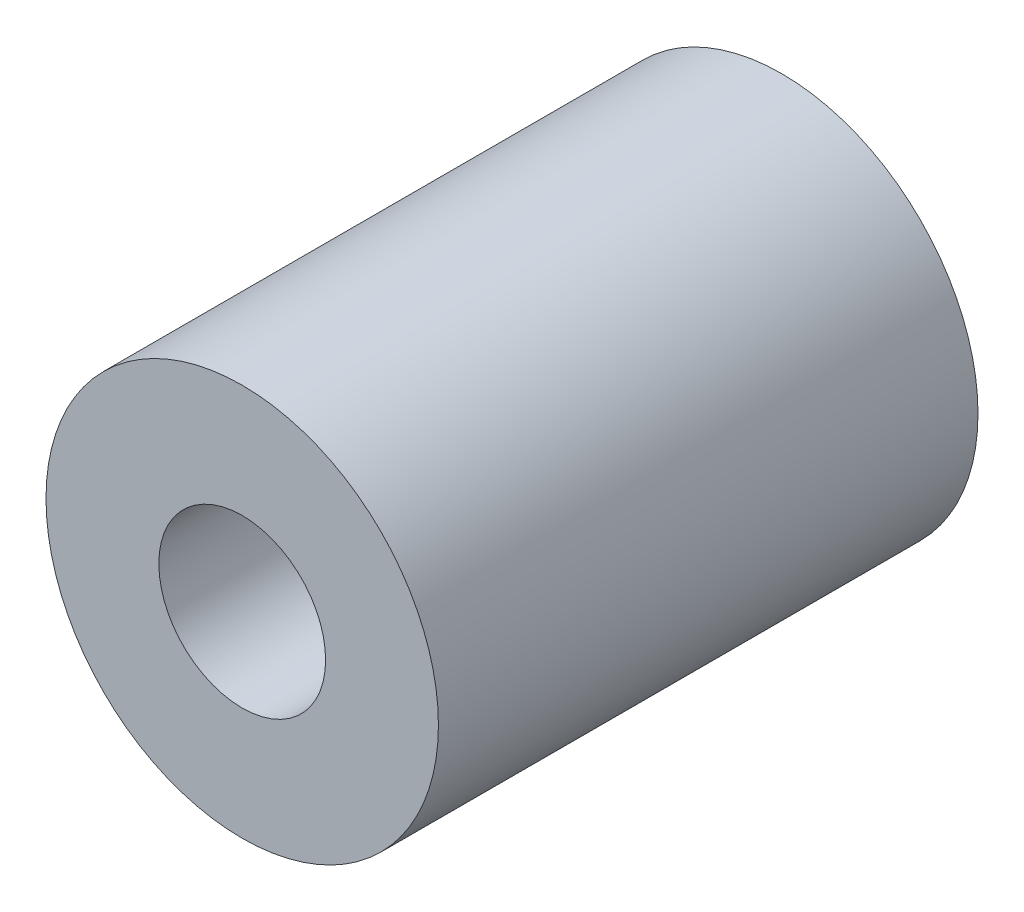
from build123d import *

# Parameters (mm, degrees)
ESQUISSE1_R      = 10
ESQUISSE1_R_2    = 4.25
EXTRUSION1_DEPTH = 13.75


with BuildPart() as part:
    # Esquisse1 → Extrusion1 (new, symmetric)
    with BuildSketch(Plane.XY):
        Circle(ESQUISSE1_R)
        Circle(ESQUISSE1_R_2, mode=Mode.SUBTRACT)
    extrude(amount=EXTRUSION1_DEPTH, both=True)


solid = part.part
